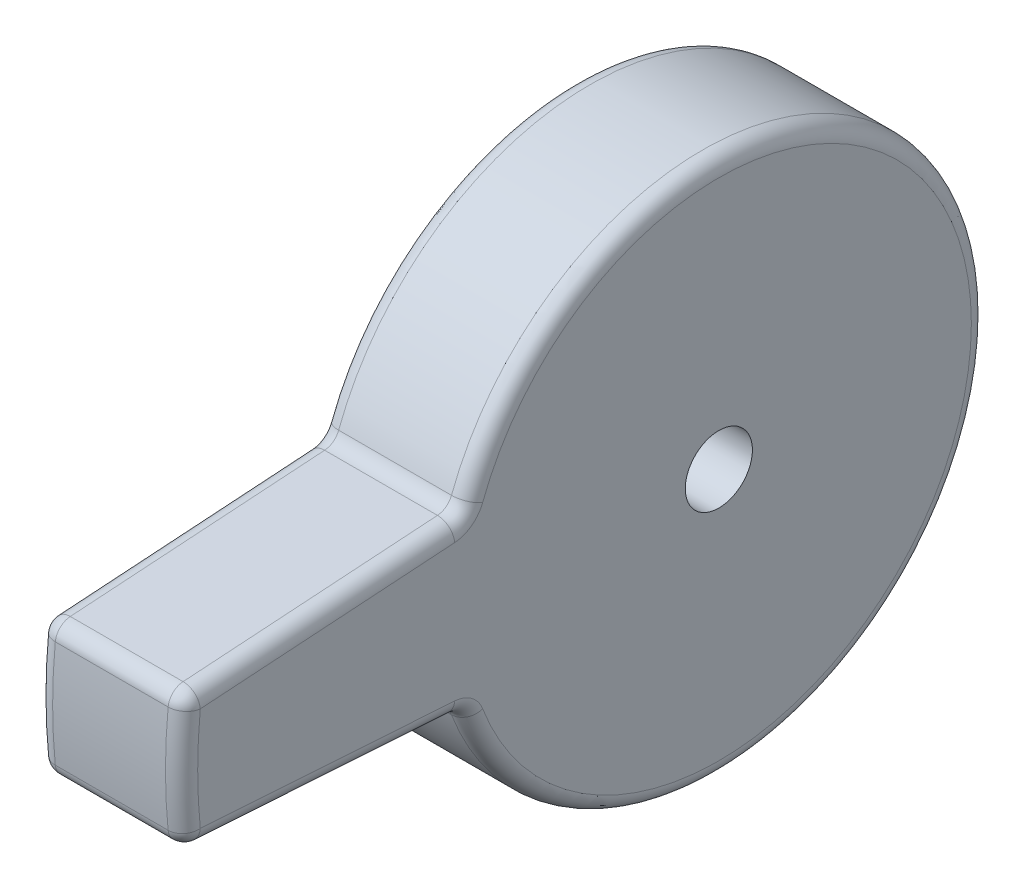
ISO-10303-21;
HEADER;
FILE_DESCRIPTION(('STEP AP214'),'2;1');
FILE_NAME('part.step','',(''),(''),'','','');
FILE_SCHEMA(('AUTOMOTIVE_DESIGN { 1 0 10303 214 1 1 1 1 }'));
ENDSEC;
DATA;
#1=APPLICATION_CONTEXT('core data for automotive mechanical design processes');
#2=APPLICATION_PROTOCOL_DEFINITION('international standard','automotive_design',2000,#1);
#3=PRODUCT_CONTEXT('',#1,'mechanical');
#4=PRODUCT('Part','Part','',(#3));
#5=PRODUCT_RELATED_PRODUCT_CATEGORY('part','',(#4));
#6=PRODUCT_DEFINITION_FORMATION('','',#4);
#7=PRODUCT_DEFINITION_CONTEXT('part definition',#1,'design');
#8=PRODUCT_DEFINITION('design','',#6,#7);
#9=PRODUCT_DEFINITION_SHAPE('','',#8);
#10=(LENGTH_UNIT() NAMED_UNIT(*) SI_UNIT(.MILLI.,.METRE.));
#11=(NAMED_UNIT(*) PLANE_ANGLE_UNIT() SI_UNIT($,.RADIAN.));
#12=(NAMED_UNIT(*) SI_UNIT($,.STERADIAN.) SOLID_ANGLE_UNIT());
#13=UNCERTAINTY_MEASURE_WITH_UNIT(LENGTH_MEASURE(1.E-05),#10,'distance_accuracy_value','');
#14=(GEOMETRIC_REPRESENTATION_CONTEXT(3) GLOBAL_UNCERTAINTY_ASSIGNED_CONTEXT((#13)) GLOBAL_UNIT_ASSIGNED_CONTEXT((#10,
#11,#12)) REPRESENTATION_CONTEXT('',''));
#15=CARTESIAN_POINT('',(0.,0.,0.));
#16=DIRECTION('',(0.,0.,1.));
#17=DIRECTION('',(1.,0.,0.));
#18=AXIS2_PLACEMENT_3D('',#15,#16,#17);
#19=CARTESIAN_POINT('',(-3.429,0.,0.));
#20=DIRECTION('',(1.,0.,0.));
#21=DIRECTION('',(0.,0.,-1.));
#22=AXIS2_PLACEMENT_3D('',#19,#20,#21);
#23=PLANE('',#22);
#24=CARTESIAN_POINT('',(-3.429,0.,0.));
#25=DIRECTION('',(1.,0.,0.));
#26=DIRECTION('',(0.,0.,-1.));
#27=AXIS2_PLACEMENT_3D('',#24,#25,#26);
#28=CIRCLE('',#27,1.5875);
#29=CARTESIAN_POINT('',(-3.429,0.,-1.5875));
#30=VERTEX_POINT('',#29);
#31=EDGE_CURVE('E224',#30,#30,#28,.T.);
#32=ORIENTED_EDGE('',*,*,#31,.T.);
#33=EDGE_LOOP('',(#32));
#34=FACE_BOUND('',#33,.T.);
#35=CARTESIAN_POINT('',(-3.429,-4.7624690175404,12.5914388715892));
#36=DIRECTION('',(1.,0.,0.));
#37=DIRECTION('',(0.,0.,-1.));
#38=AXIS2_PLACEMENT_3D('',#35,#36,#37);
#39=CIRCLE('',#38,1.524);
#40=CARTESIAN_POINT('',(-3.429,-3.24177580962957,12.491098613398));
#41=VERTEX_POINT('',#40);
#42=CARTESIAN_POINT('',(-3.429,-4.22332158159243,11.165992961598));
#43=VERTEX_POINT('',#42);
#44=EDGE_CURVE('E264',#41,#43,#39,.F.);
#45=ORIENTED_EDGE('',*,*,#44,.F.);
#46=DIRECTION('',(0.,-0.0658400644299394,-0.997830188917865));
#47=VECTOR('',#46,1.);
#48=CARTESIAN_POINT('',(-3.429,-4.04835324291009,0.267123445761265));
#49=LINE('',#48,#47);
#50=CARTESIAN_POINT('',(-3.429,-2.44833059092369,24.5160502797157));
#51=VERTEX_POINT('',#50);
#52=EDGE_CURVE('E262',#41,#51,#49,.F.);
#53=ORIENTED_EDGE('',*,*,#52,.T.);
#54=CARTESIAN_POINT('',(-3.429,0.,0.));
#55=DIRECTION('',(1.,0.,0.));
#56=DIRECTION('',(0.,0.,-1.));
#57=AXIS2_PLACEMENT_3D('',#54,#55,#56);
#58=CIRCLE('',#57,24.638);
#59=CARTESIAN_POINT('',(-3.429,2.44833059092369,24.5160502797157));
#60=VERTEX_POINT('',#59);
#61=EDGE_CURVE('E257',#51,#60,#58,.F.);
#62=ORIENTED_EDGE('',*,*,#61,.T.);
#63=DIRECTION('',(0.,-0.0658400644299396,0.997830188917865));
#64=VECTOR('',#63,1.);
#65=CARTESIAN_POINT('',(-3.429,4.04835324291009,0.267123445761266));
#66=LINE('',#65,#64);
#67=CARTESIAN_POINT('',(-3.429,3.24177580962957,12.491098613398));
#68=VERTEX_POINT('',#67);
#69=EDGE_CURVE('E255',#60,#68,#66,.F.);
#70=ORIENTED_EDGE('',*,*,#69,.T.);
#71=CARTESIAN_POINT('',(-3.429,4.7624690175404,12.5914388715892));
#72=DIRECTION('',(1.,0.,0.));
#73=DIRECTION('',(0.,0.,-1.));
#74=AXIS2_PLACEMENT_3D('',#71,#72,#73);
#75=CIRCLE('',#74,1.524);
#76=CARTESIAN_POINT('',(-3.429,4.22332158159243,11.165992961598));
#77=VERTEX_POINT('',#76);
#78=EDGE_CURVE('E252',#77,#68,#75,.F.);
#79=ORIENTED_EDGE('',*,*,#78,.F.);
#80=CARTESIAN_POINT('',(-3.429,0.,0.));
#81=DIRECTION('',(1.,0.,0.));
#82=DIRECTION('',(0.,0.,-1.));
#83=AXIS2_PLACEMENT_3D('',#80,#81,#82);
#84=CIRCLE('',#83,11.938);
#85=EDGE_CURVE('E259',#77,#43,#84,.F.);
#86=ORIENTED_EDGE('',*,*,#85,.T.);
#87=EDGE_LOOP('',(#45,#53,#62,#70,#79,#86));
#88=FACE_BOUND('',#87,.T.);
#89=ADVANCED_FACE('F35',(#34,#88),#23,.F.);
#90=CARTESIAN_POINT('',(3.429,0.,0.));
#91=DIRECTION('',(1.,0.,0.));
#92=DIRECTION('',(0.,0.,-1.));
#93=AXIS2_PLACEMENT_3D('',#90,#91,#92);
#94=PLANE('',#93);
#95=CARTESIAN_POINT('',(3.429,0.,0.));
#96=DIRECTION('',(1.,0.,0.));
#97=DIRECTION('',(0.,0.,-1.));
#98=AXIS2_PLACEMENT_3D('',#95,#96,#97);
#99=CIRCLE('',#98,24.638);
#100=CARTESIAN_POINT('',(3.429,2.44833059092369,24.5160502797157));
#101=VERTEX_POINT('',#100);
#102=CARTESIAN_POINT('',(3.429,-2.44833059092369,24.5160502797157));
#103=VERTEX_POINT('',#102);
#104=EDGE_CURVE('E146',#101,#103,#99,.T.);
#105=ORIENTED_EDGE('',*,*,#104,.T.);
#106=DIRECTION('',(0.,-0.0658400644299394,-0.997830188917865));
#107=VECTOR('',#106,1.);
#108=CARTESIAN_POINT('',(3.429,-3.27472343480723,11.991765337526));
#109=LINE('',#108,#107);
#110=CARTESIAN_POINT('',(3.429,-3.24177580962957,12.491098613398));
#111=VERTEX_POINT('',#110);
#112=EDGE_CURVE('E241',#103,#111,#109,.T.);
#113=ORIENTED_EDGE('',*,*,#112,.T.);
#114=CARTESIAN_POINT('',(3.429,-4.7624690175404,12.5914388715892));
#115=DIRECTION('',(1.,0.,0.));
#116=DIRECTION('',(0.,0.,-1.));
#117=AXIS2_PLACEMENT_3D('',#114,#115,#116);
#118=CIRCLE('',#117,1.524);
#119=CARTESIAN_POINT('',(3.429,-4.22332158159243,11.165992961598));
#120=VERTEX_POINT('',#119);
#121=EDGE_CURVE('E238',#120,#111,#118,.T.);
#122=ORIENTED_EDGE('',*,*,#121,.F.);
#123=CARTESIAN_POINT('',(3.429,0.,0.));
#124=DIRECTION('',(1.,0.,0.));
#125=DIRECTION('',(0.,0.,-1.));
#126=AXIS2_PLACEMENT_3D('',#123,#124,#125);
#127=CIRCLE('',#126,11.938);
#128=CARTESIAN_POINT('',(3.429,4.22332158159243,11.165992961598));
#129=VERTEX_POINT('',#128);
#130=EDGE_CURVE('E142',#120,#129,#127,.T.);
#131=ORIENTED_EDGE('',*,*,#130,.T.);
#132=CARTESIAN_POINT('',(3.429,4.7624690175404,12.5914388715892));
#133=DIRECTION('',(1.,0.,0.));
#134=DIRECTION('',(0.,0.,-1.));
#135=AXIS2_PLACEMENT_3D('',#132,#133,#134);
#136=CIRCLE('',#135,1.524);
#137=CARTESIAN_POINT('',(3.429,3.24177580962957,12.491098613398));
#138=VERTEX_POINT('',#137);
#139=EDGE_CURVE('E135',#138,#129,#136,.T.);
#140=ORIENTED_EDGE('',*,*,#139,.F.);
#141=DIRECTION('',(0.,-0.0658400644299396,0.997830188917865));
#142=VECTOR('',#141,1.);
#143=CARTESIAN_POINT('',(3.429,2.40639162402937,25.1516506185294));
#144=LINE('',#143,#142);
#145=EDGE_CURVE('E139',#138,#101,#144,.T.);
#146=ORIENTED_EDGE('',*,*,#145,.T.);
#147=EDGE_LOOP('',(#105,#113,#122,#131,#140,#146));
#148=FACE_BOUND('',#147,.T.);
#149=CARTESIAN_POINT('',(3.429,0.,0.));
#150=DIRECTION('',(1.,0.,0.));
#151=DIRECTION('',(0.,0.,-1.));
#152=AXIS2_PLACEMENT_3D('',#149,#150,#151);
#153=CIRCLE('',#152,1.5875);
#154=CARTESIAN_POINT('',(3.429,0.,-1.5875));
#155=VERTEX_POINT('',#154);
#156=EDGE_CURVE('E156',#155,#155,#153,.T.);
#157=ORIENTED_EDGE('',*,*,#156,.F.);
#158=EDGE_LOOP('',(#157));
#159=FACE_BOUND('',#158,.T.);
#160=ADVANCED_FACE('F137',(#148,#159),#94,.T.);
#161=CARTESIAN_POINT('',(3.429,0.,0.));
#162=DIRECTION('',(-1.,0.,0.));
#163=DIRECTION('',(0.,0.,1.));
#164=AXIS2_PLACEMENT_3D('',#161,#162,#163);
#165=CYLINDRICAL_SURFACE('',#164,12.7);
#166=CARTESIAN_POINT('',(2.667,0.,0.));
#167=DIRECTION('',(1.,0.,0.));
#168=DIRECTION('',(0.,0.,-1.));
#169=AXIS2_PLACEMENT_3D('',#166,#167,#168);
#170=CIRCLE('',#169,12.7);
#171=CARTESIAN_POINT('',(2.667,4.49289529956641,11.8787159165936));
#172=VERTEX_POINT('',#171);
#173=CARTESIAN_POINT('',(2.667,-4.49289529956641,11.8787159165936));
#174=VERTEX_POINT('',#173);
#175=EDGE_CURVE('E247',#172,#174,#170,.F.);
#176=ORIENTED_EDGE('',*,*,#175,.T.);
#177=DIRECTION('',(-1.,0.,0.));
#178=VECTOR('',#177,1.);
#179=CARTESIAN_POINT('',(3.429,-4.49289529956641,11.8787159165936));
#180=LINE('',#179,#178);
#181=CARTESIAN_POINT('',(-2.667,-4.49289529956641,11.8787159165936));
#182=VERTEX_POINT('',#181);
#183=EDGE_CURVE('E250',#174,#182,#180,.T.);
#184=ORIENTED_EDGE('',*,*,#183,.T.);
#185=CARTESIAN_POINT('',(-2.667,0.,0.));
#186=DIRECTION('',(1.,0.,0.));
#187=DIRECTION('',(0.,0.,-1.));
#188=AXIS2_PLACEMENT_3D('',#185,#186,#187);
#189=CIRCLE('',#188,12.7);
#190=CARTESIAN_POINT('',(-2.667,4.49289529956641,11.8787159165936));
#191=VERTEX_POINT('',#190);
#192=EDGE_CURVE('E245',#182,#191,#189,.T.);
#193=ORIENTED_EDGE('',*,*,#192,.T.);
#194=DIRECTION('',(-1.,0.,0.));
#195=VECTOR('',#194,1.);
#196=CARTESIAN_POINT('',(3.429,4.49289529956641,11.8787159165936));
#197=LINE('',#196,#195);
#198=EDGE_CURVE('E243',#191,#172,#197,.F.);
#199=ORIENTED_EDGE('',*,*,#198,.T.);
#200=EDGE_LOOP('',(#176,#184,#193,#199));
#201=FACE_BOUND('',#200,.T.);
#202=ADVANCED_FACE('F303',(#201),#165,.T.);
#203=CARTESIAN_POINT('',(3.429,3.16673822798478,25.201820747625));
#204=DIRECTION('',(0.,-0.997830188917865,-0.0658400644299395));
#205=DIRECTION('',(0.,0.0658400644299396,-0.997830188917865));
#206=AXIS2_PLACEMENT_3D('',#203,#204,#205);
#207=PLANE('',#206);
#208=DIRECTION('',(1.,0.,0.));
#209=VECTOR('',#208,1.);
#210=CARTESIAN_POINT('',(-3.429,4.00212241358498,12.5412687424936));
#211=LINE('',#210,#209);
#212=CARTESIAN_POINT('',(2.667,4.00212241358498,12.5412687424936));
#213=VERTEX_POINT('',#212);
#214=CARTESIAN_POINT('',(-2.667,4.00212241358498,12.5412687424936));
#215=VERTEX_POINT('',#214);
#216=EDGE_CURVE('E277',#213,#215,#211,.F.);
#217=ORIENTED_EDGE('',*,*,#216,.T.);
#218=DIRECTION('',(0.,-0.0658400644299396,0.997830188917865));
#219=VECTOR('',#218,1.);
#220=CARTESIAN_POINT('',(-2.667,3.16673822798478,25.201820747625));
#221=LINE('',#220,#219);
#222=CARTESIAN_POINT('',(-2.667,3.2086771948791,24.5662204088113));
#223=VERTEX_POINT('',#222);
#224=EDGE_CURVE('E282',#215,#223,#221,.T.);
#225=ORIENTED_EDGE('',*,*,#224,.T.);
#226=DIRECTION('',(-1.,0.,0.));
#227=VECTOR('',#226,1.);
#228=CARTESIAN_POINT('',(3.429,3.2086771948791,24.5662204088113));
#229=LINE('',#228,#227);
#230=CARTESIAN_POINT('',(2.667,3.2086771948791,24.5662204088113));
#231=VERTEX_POINT('',#230);
#232=EDGE_CURVE('E279',#223,#231,#229,.F.);
#233=ORIENTED_EDGE('',*,*,#232,.T.);
#234=DIRECTION('',(0.,-0.0658400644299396,0.997830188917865));
#235=VECTOR('',#234,1.);
#236=CARTESIAN_POINT('',(2.667,4.03507003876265,12.0419354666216));
#237=LINE('',#236,#235);
#238=EDGE_CURVE('E275',#231,#213,#237,.F.);
#239=ORIENTED_EDGE('',*,*,#238,.T.);
#240=EDGE_LOOP('',(#217,#225,#233,#239));
#241=FACE_BOUND('',#240,.T.);
#242=ADVANCED_FACE('F312',(#241),#207,.F.);
#243=CARTESIAN_POINT('',(3.429,0.,0.));
#244=DIRECTION('',(-1.,0.,0.));
#245=DIRECTION('',(0.,0.,1.));
#246=AXIS2_PLACEMENT_3D('',#243,#244,#245);
#247=CYLINDRICAL_SURFACE('',#246,25.4);
#248=CARTESIAN_POINT('',(2.667,0.,0.));
#249=DIRECTION('',(1.,0.,0.));
#250=DIRECTION('',(0.,0.,-1.));
#251=AXIS2_PLACEMENT_3D('',#248,#249,#250);
#252=CIRCLE('',#251,25.4);
#253=CARTESIAN_POINT('',(2.667,-2.52405215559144,25.2742786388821));
#254=VERTEX_POINT('',#253);
#255=CARTESIAN_POINT('',(2.667,2.52405215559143,25.2742786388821));
#256=VERTEX_POINT('',#255);
#257=EDGE_CURVE('E270',#254,#256,#252,.F.);
#258=ORIENTED_EDGE('',*,*,#257,.T.);
#259=DIRECTION('',(-1.,0.,0.));
#260=VECTOR('',#259,1.);
#261=CARTESIAN_POINT('',(3.429,2.52405215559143,25.2742786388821));
#262=LINE('',#261,#260);
#263=CARTESIAN_POINT('',(-2.667,2.52405215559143,25.2742786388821));
#264=VERTEX_POINT('',#263);
#265=EDGE_CURVE('E272',#256,#264,#262,.T.);
#266=ORIENTED_EDGE('',*,*,#265,.T.);
#267=CARTESIAN_POINT('',(-2.667,0.,0.));
#268=DIRECTION('',(1.,0.,0.));
#269=DIRECTION('',(0.,0.,-1.));
#270=AXIS2_PLACEMENT_3D('',#267,#268,#269);
#271=CIRCLE('',#270,25.4);
#272=CARTESIAN_POINT('',(-2.667,-2.52405215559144,25.2742786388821));
#273=VERTEX_POINT('',#272);
#274=EDGE_CURVE('E266',#264,#273,#271,.T.);
#275=ORIENTED_EDGE('',*,*,#274,.T.);
#276=DIRECTION('',(-1.,0.,0.));
#277=VECTOR('',#276,1.);
#278=CARTESIAN_POINT('',(3.429,-2.52405215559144,25.2742786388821));
#279=LINE('',#278,#277);
#280=EDGE_CURVE('E268',#273,#254,#279,.F.);
#281=ORIENTED_EDGE('',*,*,#280,.T.);
#282=EDGE_LOOP('',(#258,#266,#275,#281));
#283=FACE_BOUND('',#282,.T.);
#284=ADVANCED_FACE('F339',(#283),#247,.T.);
#285=CARTESIAN_POINT('',(3.429,-4.03507003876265,12.0419354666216));
#286=DIRECTION('',(0.,0.997830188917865,-0.0658400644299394));
#287=DIRECTION('',(0.,0.0658400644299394,0.997830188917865));
#288=AXIS2_PLACEMENT_3D('',#285,#286,#287);
#289=PLANE('',#288);
#290=DIRECTION('',(1.,0.,0.));
#291=VECTOR('',#290,1.);
#292=CARTESIAN_POINT('',(3.429,-4.00212241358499,12.5412687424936));
#293=LINE('',#292,#291);
#294=CARTESIAN_POINT('',(-2.667,-4.00212241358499,12.5412687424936));
#295=VERTEX_POINT('',#294);
#296=CARTESIAN_POINT('',(2.667,-4.00212241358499,12.5412687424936));
#297=VERTEX_POINT('',#296);
#298=EDGE_CURVE('E55',#295,#297,#293,.T.);
#299=ORIENTED_EDGE('',*,*,#298,.T.);
#300=DIRECTION('',(0.,-0.0658400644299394,-0.997830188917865));
#301=VECTOR('',#300,1.);
#302=CARTESIAN_POINT('',(2.667,-3.16673822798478,25.201820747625));
#303=LINE('',#302,#301);
#304=CARTESIAN_POINT('',(2.667,-3.20867719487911,24.5662204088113));
#305=VERTEX_POINT('',#304);
#306=EDGE_CURVE('E11',#297,#305,#303,.F.);
#307=ORIENTED_EDGE('',*,*,#306,.T.);
#308=DIRECTION('',(-1.,0.,0.));
#309=VECTOR('',#308,1.);
#310=CARTESIAN_POINT('',(3.429,-3.20867719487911,24.5662204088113));
#311=LINE('',#310,#309);
#312=CARTESIAN_POINT('',(-2.667,-3.20867719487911,24.5662204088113));
#313=VERTEX_POINT('',#312);
#314=EDGE_CURVE('E44',#305,#313,#311,.T.);
#315=ORIENTED_EDGE('',*,*,#314,.T.);
#316=DIRECTION('',(0.,-0.0658400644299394,-0.997830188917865));
#317=VECTOR('',#316,1.);
#318=CARTESIAN_POINT('',(-2.667,-4.03507003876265,12.0419354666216));
#319=LINE('',#318,#317);
#320=EDGE_CURVE('E284',#313,#295,#319,.T.);
#321=ORIENTED_EDGE('',*,*,#320,.T.);
#322=EDGE_LOOP('',(#299,#307,#315,#321));
#323=FACE_BOUND('',#322,.T.);
#324=ADVANCED_FACE('F336',(#323),#289,.F.);
#325=CARTESIAN_POINT('',(3.429,0.,0.));
#326=DIRECTION('',(-1.,0.,0.));
#327=DIRECTION('',(0.,0.,1.));
#328=AXIS2_PLACEMENT_3D('',#325,#326,#327);
#329=CYLINDRICAL_SURFACE('',#328,1.5875);
#330=ORIENTED_EDGE('',*,*,#156,.T.);
#331=EDGE_LOOP('',(#330));
#332=FACE_BOUND('',#331,.T.);
#333=ORIENTED_EDGE('',*,*,#31,.F.);
#334=EDGE_LOOP('',(#333));
#335=FACE_BOUND('',#334,.T.);
#336=ADVANCED_FACE('F338',(#332,#335),#329,.F.);
#337=CARTESIAN_POINT('',(-2.667,0.,0.));
#338=DIRECTION('',(1.,0.,0.));
#339=DIRECTION('',(0.,0.,-1.));
#340=AXIS2_PLACEMENT_3D('',#337,#338,#339);
#341=TOROIDAL_SURFACE('',#340,24.638,0.762);
#342=CARTESIAN_POINT('',(-2.667,-2.44833059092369,24.5160502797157));
#343=DIRECTION('',(0.,-0.99505034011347,-0.0993721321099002));
#344=DIRECTION('',(0.,0.0993721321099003,-0.99505034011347));
#345=AXIS2_PLACEMENT_3D('',#342,#343,#344);
#346=CIRCLE('',#345,0.762);
#347=EDGE_CURVE('E39',#273,#51,#346,.T.);
#348=ORIENTED_EDGE('',*,*,#347,.F.);
#349=ORIENTED_EDGE('',*,*,#274,.F.);
#350=CARTESIAN_POINT('',(-2.667,2.44833059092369,24.5160502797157));
#351=DIRECTION('',(0.,0.99505034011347,-0.099372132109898));
#352=DIRECTION('',(0.,0.099372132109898,0.99505034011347));
#353=AXIS2_PLACEMENT_3D('',#350,#351,#352);
#354=CIRCLE('',#353,0.762);
#355=EDGE_CURVE('E216',#60,#264,#354,.T.);
#356=ORIENTED_EDGE('',*,*,#355,.F.);
#357=ORIENTED_EDGE('',*,*,#61,.F.);
#358=EDGE_LOOP('',(#348,#349,#356,#357));
#359=FACE_BOUND('',#358,.T.);
#360=ADVANCED_FACE('F37',(#359),#341,.T.);
#361=CARTESIAN_POINT('',(-2.667,-2.44833059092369,24.5160502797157));
#362=DIRECTION('',(0.,0.,1.));
#363=DIRECTION('',(1.,0.,0.));
#364=AXIS2_PLACEMENT_3D('',#361,#362,#363);
#365=SPHERICAL_SURFACE('',#364,0.762);
#366=CARTESIAN_POINT('',(-2.667,-2.44833059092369,24.5160502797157));
#367=DIRECTION('',(-1.,0.,0.));
#368=DIRECTION('',(0.,0.,1.));
#369=AXIS2_PLACEMENT_3D('',#366,#367,#368);
#370=CIRCLE('',#369,0.762);
#371=EDGE_CURVE('E211',#273,#313,#370,.F.);
#372=ORIENTED_EDGE('',*,*,#371,.F.);
#373=ORIENTED_EDGE('',*,*,#347,.T.);
#374=CARTESIAN_POINT('',(-2.667,-2.44833059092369,24.5160502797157));
#375=DIRECTION('',(0.,0.0658400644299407,0.997830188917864));
#376=DIRECTION('',(0.,-0.997830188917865,0.0658400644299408));
#377=AXIS2_PLACEMENT_3D('',#374,#375,#376);
#378=CIRCLE('',#377,0.762);
#379=EDGE_CURVE('E214',#313,#51,#378,.F.);
#380=ORIENTED_EDGE('',*,*,#379,.F.);
#381=EDGE_LOOP('',(#372,#373,#380));
#382=FACE_BOUND('',#381,.T.);
#383=ADVANCED_FACE('F331',(#382),#365,.T.);
#384=CARTESIAN_POINT('',(-2.667,2.44833059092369,24.5160502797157));
#385=DIRECTION('',(0.,0.,1.));
#386=DIRECTION('',(1.,0.,0.));
#387=AXIS2_PLACEMENT_3D('',#384,#385,#386);
#388=SPHERICAL_SURFACE('',#387,0.762);
#389=CARTESIAN_POINT('',(-2.667,2.44833059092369,24.5160502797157));
#390=DIRECTION('',(0.,-0.0658400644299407,0.997830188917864));
#391=DIRECTION('',(0.,-0.997830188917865,-0.0658400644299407));
#392=AXIS2_PLACEMENT_3D('',#389,#390,#391);
#393=CIRCLE('',#392,0.762);
#394=EDGE_CURVE('E206',#60,#223,#393,.F.);
#395=ORIENTED_EDGE('',*,*,#394,.F.);
#396=ORIENTED_EDGE('',*,*,#355,.T.);
#397=CARTESIAN_POINT('',(-2.667,2.44833059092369,24.5160502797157));
#398=DIRECTION('',(-1.,0.,0.));
#399=DIRECTION('',(0.,0.,1.));
#400=AXIS2_PLACEMENT_3D('',#397,#398,#399);
#401=CIRCLE('',#400,0.762);
#402=EDGE_CURVE('E209',#223,#264,#401,.F.);
#403=ORIENTED_EDGE('',*,*,#402,.F.);
#404=EDGE_LOOP('',(#395,#396,#403));
#405=FACE_BOUND('',#404,.T.);
#406=ADVANCED_FACE('F408',(#405),#388,.T.);
#407=CARTESIAN_POINT('',(-2.667,-3.27472343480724,11.991765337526));
#408=DIRECTION('',(0.,-0.0658400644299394,-0.997830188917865));
#409=DIRECTION('',(0.,0.997830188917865,-0.0658400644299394));
#410=AXIS2_PLACEMENT_3D('',#407,#408,#409);
#411=CYLINDRICAL_SURFACE('',#410,0.762);
#412=ORIENTED_EDGE('',*,*,#379,.T.);
#413=ORIENTED_EDGE('',*,*,#52,.F.);
#414=CARTESIAN_POINT('',(-2.667,-3.24177580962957,12.491098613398));
#415=DIRECTION('',(0.,-0.0658400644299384,-0.997830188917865));
#416=DIRECTION('',(0.,0.997830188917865,-0.0658400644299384));
#417=AXIS2_PLACEMENT_3D('',#414,#415,#416);
#418=CIRCLE('',#417,0.762);
#419=EDGE_CURVE('E200',#295,#41,#418,.T.);
#420=ORIENTED_EDGE('',*,*,#419,.F.);
#421=ORIENTED_EDGE('',*,*,#320,.F.);
#422=EDGE_LOOP('',(#412,#413,#420,#421));
#423=FACE_BOUND('',#422,.T.);
#424=ADVANCED_FACE('F330',(#423),#411,.T.);
#425=CARTESIAN_POINT('',(3.429,-2.44833059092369,24.5160502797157));
#426=DIRECTION('',(-1.,0.,0.));
#427=DIRECTION('',(0.,0.,1.));
#428=AXIS2_PLACEMENT_3D('',#425,#426,#427);
#429=CYLINDRICAL_SURFACE('',#428,0.762);
#430=ORIENTED_EDGE('',*,*,#371,.T.);
#431=ORIENTED_EDGE('',*,*,#314,.F.);
#432=CARTESIAN_POINT('',(2.667,-2.44833059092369,24.5160502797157));
#433=DIRECTION('',(1.,0.,0.));
#434=DIRECTION('',(0.,0.,-1.));
#435=AXIS2_PLACEMENT_3D('',#432,#433,#434);
#436=CIRCLE('',#435,0.762);
#437=EDGE_CURVE('E197',#254,#305,#436,.T.);
#438=ORIENTED_EDGE('',*,*,#437,.F.);
#439=ORIENTED_EDGE('',*,*,#280,.F.);
#440=EDGE_LOOP('',(#430,#431,#438,#439));
#441=FACE_BOUND('',#440,.T.);
#442=ADVANCED_FACE('F334',(#441),#429,.T.);
#443=CARTESIAN_POINT('',(2.667,0.,0.));
#444=DIRECTION('',(1.,0.,0.));
#445=DIRECTION('',(0.,0.,-1.));
#446=AXIS2_PLACEMENT_3D('',#443,#444,#445);
#447=TOROIDAL_SURFACE('',#446,24.638,0.762);
#448=CARTESIAN_POINT('',(2.667,2.44833059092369,24.5160502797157));
#449=DIRECTION('',(0.,0.99505034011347,-0.099372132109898));
#450=DIRECTION('',(0.,0.099372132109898,0.99505034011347));
#451=AXIS2_PLACEMENT_3D('',#448,#449,#450);
#452=CIRCLE('',#451,0.762);
#453=EDGE_CURVE('E191',#256,#101,#452,.T.);
#454=ORIENTED_EDGE('',*,*,#453,.F.);
#455=ORIENTED_EDGE('',*,*,#257,.F.);
#456=CARTESIAN_POINT('',(2.667,-2.44833059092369,24.5160502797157));
#457=DIRECTION('',(0.,-0.99505034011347,-0.0993721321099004));
#458=DIRECTION('',(0.,0.0993721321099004,-0.99505034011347));
#459=AXIS2_PLACEMENT_3D('',#456,#457,#458);
#460=CIRCLE('',#459,0.762);
#461=EDGE_CURVE('E194',#103,#254,#460,.T.);
#462=ORIENTED_EDGE('',*,*,#461,.F.);
#463=ORIENTED_EDGE('',*,*,#104,.F.);
#464=EDGE_LOOP('',(#454,#455,#462,#463));
#465=FACE_BOUND('',#464,.T.);
#466=ADVANCED_FACE('F399',(#465),#447,.T.);
#467=CARTESIAN_POINT('',(3.429,2.44833059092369,24.5160502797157));
#468=DIRECTION('',(-1.,0.,0.));
#469=DIRECTION('',(0.,0.,1.));
#470=AXIS2_PLACEMENT_3D('',#467,#468,#469);
#471=CYLINDRICAL_SURFACE('',#470,0.762);
#472=ORIENTED_EDGE('',*,*,#402,.T.);
#473=ORIENTED_EDGE('',*,*,#265,.F.);
#474=CARTESIAN_POINT('',(2.667,2.44833059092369,24.5160502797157));
#475=DIRECTION('',(1.,0.,0.));
#476=DIRECTION('',(0.,0.,-1.));
#477=AXIS2_PLACEMENT_3D('',#474,#475,#476);
#478=CIRCLE('',#477,0.762);
#479=EDGE_CURVE('E188',#231,#256,#478,.T.);
#480=ORIENTED_EDGE('',*,*,#479,.F.);
#481=ORIENTED_EDGE('',*,*,#232,.F.);
#482=EDGE_LOOP('',(#472,#473,#480,#481));
#483=FACE_BOUND('',#482,.T.);
#484=ADVANCED_FACE('F396',(#483),#471,.T.);
#485=CARTESIAN_POINT('',(-2.667,2.40639162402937,25.1516506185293));
#486=DIRECTION('',(0.,-0.0658400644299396,0.997830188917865));
#487=DIRECTION('',(0.,-0.997830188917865,-0.0658400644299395));
#488=AXIS2_PLACEMENT_3D('',#485,#486,#487);
#489=CYLINDRICAL_SURFACE('',#488,0.762);
#490=ORIENTED_EDGE('',*,*,#394,.T.);
#491=ORIENTED_EDGE('',*,*,#224,.F.);
#492=CARTESIAN_POINT('',(-2.667,3.24177580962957,12.491098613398));
#493=DIRECTION('',(0.,0.0658400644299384,-0.997830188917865));
#494=DIRECTION('',(0.,0.997830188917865,0.0658400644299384));
#495=AXIS2_PLACEMENT_3D('',#492,#493,#494);
#496=CIRCLE('',#495,0.762);
#497=EDGE_CURVE('E185',#68,#215,#496,.T.);
#498=ORIENTED_EDGE('',*,*,#497,.F.);
#499=ORIENTED_EDGE('',*,*,#69,.F.);
#500=EDGE_LOOP('',(#490,#491,#498,#499));
#501=FACE_BOUND('',#500,.T.);
#502=ADVANCED_FACE('F315',(#501),#489,.T.);
#503=CARTESIAN_POINT('',(-2.667,0.,0.));
#504=DIRECTION('',(1.,0.,0.));
#505=DIRECTION('',(0.,0.,-1.));
#506=AXIS2_PLACEMENT_3D('',#503,#504,#505);
#507=TOROIDAL_SURFACE('',#506,11.938,0.762);
#508=CARTESIAN_POINT('',(-2.667,-4.22332158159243,11.165992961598));
#509=DIRECTION('',(0.,0.935331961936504,0.353771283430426));
#510=DIRECTION('',(0.,-0.353771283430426,0.935331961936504));
#511=AXIS2_PLACEMENT_3D('',#508,#509,#510);
#512=CIRCLE('',#511,0.762);
#513=EDGE_CURVE('E203',#43,#182,#512,.T.);
#514=ORIENTED_EDGE('',*,*,#513,.F.);
#515=ORIENTED_EDGE('',*,*,#85,.F.);
#516=CARTESIAN_POINT('',(-2.667,4.22332158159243,11.165992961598));
#517=DIRECTION('',(0.,-0.935331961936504,0.353771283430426));
#518=DIRECTION('',(0.,-0.353771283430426,-0.935331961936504));
#519=AXIS2_PLACEMENT_3D('',#516,#517,#518);
#520=CIRCLE('',#519,0.762);
#521=EDGE_CURVE('E182',#191,#77,#520,.T.);
#522=ORIENTED_EDGE('',*,*,#521,.F.);
#523=ORIENTED_EDGE('',*,*,#192,.F.);
#524=EDGE_LOOP('',(#514,#515,#522,#523));
#525=FACE_BOUND('',#524,.T.);
#526=ADVANCED_FACE('F323',(#525),#507,.T.);
#527=CARTESIAN_POINT('',(-2.667,-4.7624690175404,12.5914388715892));
#528=DIRECTION('',(1.,0.,0.));
#529=DIRECTION('',(0.,0.,-1.));
#530=AXIS2_PLACEMENT_3D('',#527,#528,#529);
#531=TOROIDAL_SURFACE('',#530,1.524,0.762);
#532=ORIENTED_EDGE('',*,*,#44,.T.);
#533=ORIENTED_EDGE('',*,*,#513,.T.);
#534=CARTESIAN_POINT('',(-2.667,-4.7624690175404,12.5914388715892));
#535=DIRECTION('',(1.,0.,0.));
#536=DIRECTION('',(0.,0.,-1.));
#537=AXIS2_PLACEMENT_3D('',#534,#535,#536);
#538=CIRCLE('',#537,0.762);
#539=EDGE_CURVE('E179',#295,#182,#538,.F.);
#540=ORIENTED_EDGE('',*,*,#539,.F.);
#541=ORIENTED_EDGE('',*,*,#419,.T.);
#542=EDGE_LOOP('',(#532,#533,#540,#541));
#543=FACE_BOUND('',#542,.T.);
#544=ADVANCED_FACE('F325',(#543),#531,.T.);
#545=CARTESIAN_POINT('',(2.667,-2.44833059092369,24.5160502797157));
#546=DIRECTION('',(0.,0.,1.));
#547=DIRECTION('',(1.,0.,0.));
#548=AXIS2_PLACEMENT_3D('',#545,#546,#547);
#549=SPHERICAL_SURFACE('',#548,0.762);
#550=ORIENTED_EDGE('',*,*,#461,.T.);
#551=ORIENTED_EDGE('',*,*,#437,.T.);
#552=CARTESIAN_POINT('',(2.667,-2.44833059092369,24.5160502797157));
#553=DIRECTION('',(0.,0.0658400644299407,0.997830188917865));
#554=DIRECTION('',(0.,-0.997830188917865,0.0658400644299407));
#555=AXIS2_PLACEMENT_3D('',#552,#553,#554);
#556=CIRCLE('',#555,0.762);
#557=EDGE_CURVE('E176',#103,#305,#556,.F.);
#558=ORIENTED_EDGE('',*,*,#557,.F.);
#559=EDGE_LOOP('',(#550,#551,#558));
#560=FACE_BOUND('',#559,.T.);
#561=ADVANCED_FACE('F385',(#560),#549,.T.);
#562=CARTESIAN_POINT('',(2.667,2.44833059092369,24.5160502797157));
#563=DIRECTION('',(0.,0.,1.));
#564=DIRECTION('',(1.,0.,0.));
#565=AXIS2_PLACEMENT_3D('',#562,#563,#564);
#566=SPHERICAL_SURFACE('',#565,0.762);
#567=ORIENTED_EDGE('',*,*,#479,.T.);
#568=ORIENTED_EDGE('',*,*,#453,.T.);
#569=CARTESIAN_POINT('',(2.667,2.44833059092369,24.5160502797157));
#570=DIRECTION('',(0.,-0.0658400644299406,0.997830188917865));
#571=DIRECTION('',(0.,-0.997830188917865,-0.0658400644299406));
#572=AXIS2_PLACEMENT_3D('',#569,#570,#571);
#573=CIRCLE('',#572,0.762);
#574=EDGE_CURVE('E155',#231,#101,#573,.F.);
#575=ORIENTED_EDGE('',*,*,#574,.F.);
#576=EDGE_LOOP('',(#567,#568,#575));
#577=FACE_BOUND('',#576,.T.);
#578=ADVANCED_FACE('F382',(#577),#566,.T.);
#579=CARTESIAN_POINT('',(-2.667,4.7624690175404,12.5914388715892));
#580=DIRECTION('',(1.,0.,0.));
#581=DIRECTION('',(0.,0.,-1.));
#582=AXIS2_PLACEMENT_3D('',#579,#580,#581);
#583=TOROIDAL_SURFACE('',#582,1.524,0.762);
#584=ORIENTED_EDGE('',*,*,#78,.T.);
#585=ORIENTED_EDGE('',*,*,#497,.T.);
#586=CARTESIAN_POINT('',(-2.667,4.7624690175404,12.5914388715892));
#587=DIRECTION('',(1.,0.,0.));
#588=DIRECTION('',(0.,0.,-1.));
#589=AXIS2_PLACEMENT_3D('',#586,#587,#588);
#590=CIRCLE('',#589,0.762);
#591=EDGE_CURVE('E172',#191,#215,#590,.F.);
#592=ORIENTED_EDGE('',*,*,#591,.F.);
#593=ORIENTED_EDGE('',*,*,#521,.T.);
#594=EDGE_LOOP('',(#584,#585,#592,#593));
#595=FACE_BOUND('',#594,.T.);
#596=ADVANCED_FACE('F318',(#595),#583,.T.);
#597=CARTESIAN_POINT('',(3.429,-4.7624690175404,12.5914388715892));
#598=DIRECTION('',(-1.,0.,0.));
#599=DIRECTION('',(0.,0.,1.));
#600=AXIS2_PLACEMENT_3D('',#597,#598,#599);
#601=CYLINDRICAL_SURFACE('',#600,0.762);
#602=ORIENTED_EDGE('',*,*,#539,.T.);
#603=ORIENTED_EDGE('',*,*,#183,.F.);
#604=CARTESIAN_POINT('',(2.667,-4.7624690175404,12.5914388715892));
#605=DIRECTION('',(1.,0.,0.));
#606=DIRECTION('',(0.,0.,-1.));
#607=AXIS2_PLACEMENT_3D('',#604,#605,#606);
#608=CIRCLE('',#607,0.762);
#609=EDGE_CURVE('E164',#297,#174,#608,.F.);
#610=ORIENTED_EDGE('',*,*,#609,.F.);
#611=ORIENTED_EDGE('',*,*,#298,.F.);
#612=EDGE_LOOP('',(#602,#603,#610,#611));
#613=FACE_BOUND('',#612,.T.);
#614=ADVANCED_FACE('F299',(#613),#601,.F.);
#615=CARTESIAN_POINT('',(2.667,-4.04835324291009,0.267123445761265));
#616=DIRECTION('',(0.,0.0658400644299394,0.997830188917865));
#617=DIRECTION('',(0.,-0.997830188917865,0.0658400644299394));
#618=AXIS2_PLACEMENT_3D('',#615,#616,#617);
#619=CYLINDRICAL_SURFACE('',#618,0.762);
#620=ORIENTED_EDGE('',*,*,#557,.T.);
#621=ORIENTED_EDGE('',*,*,#306,.F.);
#622=CARTESIAN_POINT('',(2.667,-3.24177580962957,12.491098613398));
#623=DIRECTION('',(0.,-0.0658400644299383,-0.997830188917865));
#624=DIRECTION('',(0.,0.997830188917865,-0.0658400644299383));
#625=AXIS2_PLACEMENT_3D('',#622,#623,#624);
#626=CIRCLE('',#625,0.762);
#627=EDGE_CURVE('E161',#111,#297,#626,.T.);
#628=ORIENTED_EDGE('',*,*,#627,.F.);
#629=ORIENTED_EDGE('',*,*,#112,.F.);
#630=EDGE_LOOP('',(#620,#621,#628,#629));
#631=FACE_BOUND('',#630,.T.);
#632=ADVANCED_FACE('F374',(#631),#619,.T.);
#633=CARTESIAN_POINT('',(2.667,4.04835324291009,0.267123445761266));
#634=DIRECTION('',(0.,0.0658400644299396,-0.997830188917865));
#635=DIRECTION('',(0.,0.997830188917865,0.0658400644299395));
#636=AXIS2_PLACEMENT_3D('',#633,#634,#635);
#637=CYLINDRICAL_SURFACE('',#636,0.762);
#638=ORIENTED_EDGE('',*,*,#574,.T.);
#639=ORIENTED_EDGE('',*,*,#145,.F.);
#640=CARTESIAN_POINT('',(2.667,3.24177580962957,12.491098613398));
#641=DIRECTION('',(0.,0.0658400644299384,-0.997830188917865));
#642=DIRECTION('',(0.,0.997830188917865,0.0658400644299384));
#643=AXIS2_PLACEMENT_3D('',#640,#641,#642);
#644=CIRCLE('',#643,0.762);
#645=EDGE_CURVE('E152',#213,#138,#644,.T.);
#646=ORIENTED_EDGE('',*,*,#645,.F.);
#647=ORIENTED_EDGE('',*,*,#238,.F.);
#648=EDGE_LOOP('',(#638,#639,#646,#647));
#649=FACE_BOUND('',#648,.T.);
#650=ADVANCED_FACE('F151',(#649),#637,.T.);
#651=CARTESIAN_POINT('',(3.429,4.7624690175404,12.5914388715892));
#652=DIRECTION('',(-1.,0.,0.));
#653=DIRECTION('',(0.,0.,1.));
#654=AXIS2_PLACEMENT_3D('',#651,#652,#653);
#655=CYLINDRICAL_SURFACE('',#654,0.762);
#656=ORIENTED_EDGE('',*,*,#591,.T.);
#657=ORIENTED_EDGE('',*,*,#216,.F.);
#658=CARTESIAN_POINT('',(2.667,4.7624690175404,12.5914388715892));
#659=DIRECTION('',(1.,0.,0.));
#660=DIRECTION('',(0.,0.,-1.));
#661=AXIS2_PLACEMENT_3D('',#658,#659,#660);
#662=CIRCLE('',#661,0.762);
#663=EDGE_CURVE('E160',#172,#213,#662,.F.);
#664=ORIENTED_EDGE('',*,*,#663,.F.);
#665=ORIENTED_EDGE('',*,*,#198,.F.);
#666=EDGE_LOOP('',(#656,#657,#664,#665));
#667=FACE_BOUND('',#666,.T.);
#668=ADVANCED_FACE('F308',(#667),#655,.F.);
#669=CARTESIAN_POINT('',(2.667,-4.7624690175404,12.5914388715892));
#670=DIRECTION('',(1.,0.,0.));
#671=DIRECTION('',(0.,0.,-1.));
#672=AXIS2_PLACEMENT_3D('',#669,#670,#671);
#673=TOROIDAL_SURFACE('',#672,1.524,0.762);
#674=ORIENTED_EDGE('',*,*,#627,.T.);
#675=ORIENTED_EDGE('',*,*,#609,.T.);
#676=CARTESIAN_POINT('',(2.667,-4.22332158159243,11.165992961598));
#677=DIRECTION('',(0.,0.935331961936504,0.353771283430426));
#678=DIRECTION('',(0.,-0.353771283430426,0.935331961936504));
#679=AXIS2_PLACEMENT_3D('',#676,#677,#678);
#680=CIRCLE('',#679,0.762);
#681=EDGE_CURVE('E166',#120,#174,#680,.F.);
#682=ORIENTED_EDGE('',*,*,#681,.F.);
#683=ORIENTED_EDGE('',*,*,#121,.T.);
#684=EDGE_LOOP('',(#674,#675,#682,#683));
#685=FACE_BOUND('',#684,.T.);
#686=ADVANCED_FACE('F296',(#685),#673,.T.);
#687=CARTESIAN_POINT('',(2.667,4.7624690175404,12.5914388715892));
#688=DIRECTION('',(1.,0.,0.));
#689=DIRECTION('',(0.,0.,-1.));
#690=AXIS2_PLACEMENT_3D('',#687,#688,#689);
#691=TOROIDAL_SURFACE('',#690,1.524,0.762);
#692=ORIENTED_EDGE('',*,*,#645,.T.);
#693=ORIENTED_EDGE('',*,*,#139,.T.);
#694=CARTESIAN_POINT('',(2.667,4.22332158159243,11.165992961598));
#695=DIRECTION('',(0.,-0.935331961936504,0.353771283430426));
#696=DIRECTION('',(0.,-0.353771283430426,-0.935331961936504));
#697=AXIS2_PLACEMENT_3D('',#694,#695,#696);
#698=CIRCLE('',#697,0.762);
#699=EDGE_CURVE('E288',#172,#129,#698,.F.);
#700=ORIENTED_EDGE('',*,*,#699,.F.);
#701=ORIENTED_EDGE('',*,*,#663,.T.);
#702=EDGE_LOOP('',(#692,#693,#700,#701));
#703=FACE_BOUND('',#702,.T.);
#704=ADVANCED_FACE('F158',(#703),#691,.T.);
#705=CARTESIAN_POINT('',(2.667,0.,0.));
#706=DIRECTION('',(1.,0.,0.));
#707=DIRECTION('',(0.,0.,-1.));
#708=AXIS2_PLACEMENT_3D('',#705,#706,#707);
#709=TOROIDAL_SURFACE('',#708,11.938,0.762);
#710=ORIENTED_EDGE('',*,*,#681,.T.);
#711=ORIENTED_EDGE('',*,*,#175,.F.);
#712=ORIENTED_EDGE('',*,*,#699,.T.);
#713=ORIENTED_EDGE('',*,*,#130,.F.);
#714=EDGE_LOOP('',(#710,#711,#712,#713));
#715=FACE_BOUND('',#714,.T.);
#716=ADVANCED_FACE('F292',(#715),#709,.T.);
#717=CLOSED_SHELL('',(#89,#160,#202,#242,#284,#324,#336,#360,#383,#406,#424,#442,#466,#484,#502,
#526,#544,#561,#578,#596,#614,#632,#650,#668,#686,#704,#716));
#718=MANIFOLD_SOLID_BREP('B2',#717);
#719=ADVANCED_BREP_SHAPE_REPRESENTATION('',(#18,#718),#14);
#720=SHAPE_DEFINITION_REPRESENTATION(#9,#719);
ENDSEC;
END-ISO-10303-21;
